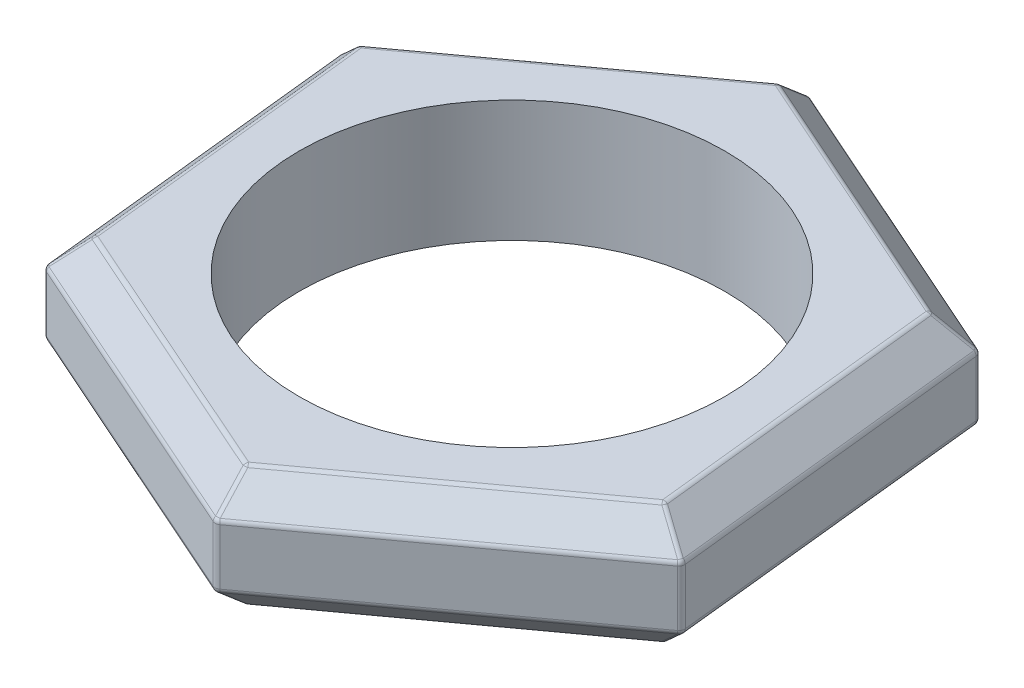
from build123d import *

# Parameters (mm, degrees)
SKETCH1_R      = 3.5
EXTRUDE1_DEPTH = 2
CHAMFER1_SIZE  = 0.5
CHAMFER2_SIZE  = 0.5
FILLET1_R      = 0.1


with BuildPart() as part:
    # Sketch1 → Extrude1 (new body)
    with BuildSketch(Plane(origin=(0, 0, 0), x_dir=(1, 0, 0), z_dir=(0, 1, 0))):
        Polygon((5.027952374, -2.229281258), (4.444590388, 3.239693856), (-0.583361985, 5.468975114), (-5.027952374, 2.229281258), (-4.444590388, -3.239693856), (0.583361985, -5.468975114), align=None)
        with Locations(Location((0, 0, 0), (0, 0, 270))):
            Circle(SKETCH1_R, mode=Mode.SUBTRACT)
    extrude(amount=EXTRUDE1_DEPTH)

    # Chamfer1
    chamfer1_edges = [part.edges().sort_by_distance(p)[0] for p in [
        (1.930614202, 2, -4.354334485),
        (-2.80565718, 2, -3.849128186),
        (-4.736271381, 2, 0.505206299),
        (-1.930614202, 2, 4.354334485),
        (2.80565718, 2, 3.849128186),
        (4.736271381, 2, -0.505206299),
    ]]
    chamfer(chamfer1_edges, length=CHAMFER1_SIZE)

    # Chamfer2
    chamfer2_edges = [part.edges().sort_by_distance(p)[0] for p in [
        (-1.930614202, 0, 4.354334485),
        (-4.736271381, 0, 0.505206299),
        (-2.80565718, 0, -3.849128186),
        (1.930614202, 0, -4.354334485),
        (4.736271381, 0, -0.505206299),
        (2.80565718, 0, 3.849128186),
    ]]
    chamfer(chamfer2_edges, length=CHAMFER2_SIZE)

    # Fillet1
    fillet1_edges = [part.edges().sort_by_distance(p)[0] for p in [
        (2.511139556, 2, 3.445074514),
        (4.239091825, 2, -0.452173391),
        (1.727952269, 2, -3.897247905),
        (-2.511139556, 2, -3.445074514),
        (-4.239091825, 2, 0.452173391),
        (-1.727952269, 2, 3.897247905),
        (0.583361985, 1, 5.468975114),
        (-4.444590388, 1, 3.239693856),
        (-1.930614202, 1.5, 4.354334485),
        (-5.027952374, 1, -2.229281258),
        (-4.736271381, 1.5, 0.505206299),
        (-0.583361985, 1, -5.468975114),
        (-2.80565718, 1.5, -3.849128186),
        (4.444590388, 1, -3.239693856),
        (1.930614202, 1.5, -4.354334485),
        (5.027952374, 1, 2.229281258),
        (4.736271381, 1.5, -0.505206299),
        (2.80565718, 1.5, 3.849128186),
        (-0.552743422, 1.75, -5.181928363),
        (4.211309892, 1.75, -3.069654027),
        (-4.764053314, 1.75, -2.112274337),
        (4.764053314, 1.75, 2.112274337),
        (-4.211309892, 1.75, 3.069654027),
        (0.552743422, 1.75, 5.181928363),
        (-4.736271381, 0.5, 0.505206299),
        (-1.727952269, 0, 3.897247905),
        (2.511139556, 0, 3.445074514),
        (4.239091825, 0, -0.452173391),
        (1.727952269, 0, -3.897247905),
        (-2.511139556, 0, -3.445074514),
        (-4.239091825, 0, 0.452173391),
        (-2.80565718, 0.5, -3.849128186),
        (1.930614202, 0.5, -4.354334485),
        (4.736271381, 0.5, -0.505206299),
        (2.80565718, 0.5, 3.849128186),
        (-1.930614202, 0.5, 4.354334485),
        (4.211309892, 0.25, -3.069654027),
        (4.764053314, 0.25, 2.112274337),
        (-0.552743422, 0.25, -5.181928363),
        (0.552743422, 0.25, 5.181928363),
        (-4.764053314, 0.25, -2.112274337),
        (-4.211309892, 0.25, 3.069654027),
    ]]
    fillet(fillet1_edges, radius=FILLET1_R)


solid = part.part
